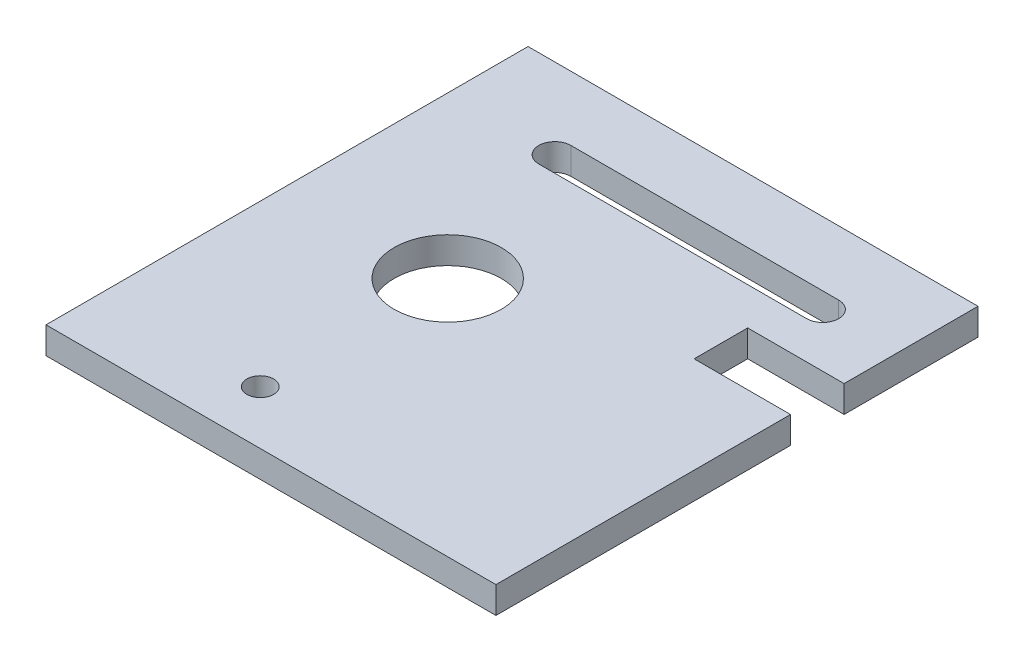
ISO-10303-21;
HEADER;
FILE_DESCRIPTION(('STEP AP214'),'2;1');
FILE_NAME('part.step','',(''),(''),'','','');
FILE_SCHEMA(('AUTOMOTIVE_DESIGN { 1 0 10303 214 1 1 1 1 }'));
ENDSEC;
DATA;
#1=APPLICATION_CONTEXT('core data for automotive mechanical design processes');
#2=APPLICATION_PROTOCOL_DEFINITION('international standard','automotive_design',2000,#1);
#3=PRODUCT_CONTEXT('',#1,'mechanical');
#4=PRODUCT('Part','Part','',(#3));
#5=PRODUCT_RELATED_PRODUCT_CATEGORY('part','',(#4));
#6=PRODUCT_DEFINITION_FORMATION('','',#4);
#7=PRODUCT_DEFINITION_CONTEXT('part definition',#1,'design');
#8=PRODUCT_DEFINITION('design','',#6,#7);
#9=PRODUCT_DEFINITION_SHAPE('','',#8);
#10=(LENGTH_UNIT() NAMED_UNIT(*) SI_UNIT(.MILLI.,.METRE.));
#11=(NAMED_UNIT(*) PLANE_ANGLE_UNIT() SI_UNIT($,.RADIAN.));
#12=(NAMED_UNIT(*) SI_UNIT($,.STERADIAN.) SOLID_ANGLE_UNIT());
#13=UNCERTAINTY_MEASURE_WITH_UNIT(LENGTH_MEASURE(1.E-05),#10,'distance_accuracy_value','');
#14=(GEOMETRIC_REPRESENTATION_CONTEXT(3) GLOBAL_UNCERTAINTY_ASSIGNED_CONTEXT((#13)) GLOBAL_UNIT_ASSIGNED_CONTEXT((#10,
#11,#12)) REPRESENTATION_CONTEXT('',''));
#15=CARTESIAN_POINT('',(0.,0.,0.));
#16=DIRECTION('',(0.,0.,1.));
#17=DIRECTION('',(1.,0.,0.));
#18=AXIS2_PLACEMENT_3D('',#15,#16,#17);
#19=CARTESIAN_POINT('',(84.,5.,0.));
#20=DIRECTION('',(-1.,0.,0.));
#21=DIRECTION('',(0.,0.,1.));
#22=AXIS2_PLACEMENT_3D('',#19,#20,#21);
#23=PLANE('',#22);
#24=DIRECTION('',(0.,0.,-1.));
#25=VECTOR('',#24,1.);
#26=CARTESIAN_POINT('',(84.,0.,0.));
#27=LINE('',#26,#25);
#28=CARTESIAN_POINT('',(84.,0.,0.));
#29=VERTEX_POINT('',#28);
#30=CARTESIAN_POINT('',(84.,0.,-55.));
#31=VERTEX_POINT('',#30);
#32=EDGE_CURVE('E217',#29,#31,#27,.T.);
#33=ORIENTED_EDGE('',*,*,#32,.T.);
#34=DIRECTION('',(0.,1.,0.));
#35=VECTOR('',#34,1.);
#36=CARTESIAN_POINT('',(84.,0.,-55.));
#37=LINE('',#36,#35);
#38=CARTESIAN_POINT('',(84.,5.,-55.));
#39=VERTEX_POINT('',#38);
#40=EDGE_CURVE('E178',#31,#39,#37,.T.);
#41=ORIENTED_EDGE('',*,*,#40,.T.);
#42=DIRECTION('',(0.,0.,-1.));
#43=VECTOR('',#42,1.);
#44=CARTESIAN_POINT('',(84.,5.,0.));
#45=LINE('',#44,#43);
#46=CARTESIAN_POINT('',(84.,5.,0.));
#47=VERTEX_POINT('',#46);
#48=EDGE_CURVE('E206',#47,#39,#45,.T.);
#49=ORIENTED_EDGE('',*,*,#48,.F.);
#50=DIRECTION('',(0.,-1.,0.));
#51=VECTOR('',#50,1.);
#52=CARTESIAN_POINT('',(84.,5.,0.));
#53=LINE('',#52,#51);
#54=EDGE_CURVE('E43',#47,#29,#53,.T.);
#55=ORIENTED_EDGE('',*,*,#54,.T.);
#56=EDGE_LOOP('',(#33,#41,#49,#55));
#57=FACE_BOUND('',#56,.T.);
#58=ADVANCED_FACE('F35',(#57),#23,.F.);
#59=CARTESIAN_POINT('',(0.,5.,-90.));
#60=DIRECTION('',(0.,-1.,0.));
#61=DIRECTION('',(0.,0.,-1.));
#62=AXIS2_PLACEMENT_3D('',#59,#60,#61);
#63=PLANE('',#62);
#64=DIRECTION('',(1.,0.,0.));
#65=VECTOR('',#64,1.);
#66=CARTESIAN_POINT('',(20.,5.,-72.));
#67=LINE('',#66,#65);
#68=CARTESIAN_POINT('',(20.,5.,-72.));
#69=VERTEX_POINT('',#68);
#70=CARTESIAN_POINT('',(70.,5.,-72.));
#71=VERTEX_POINT('',#70);
#72=EDGE_CURVE('E151',#69,#71,#67,.T.);
#73=ORIENTED_EDGE('',*,*,#72,.F.);
#74=CARTESIAN_POINT('',(20.,5.,-75.));
#75=DIRECTION('',(0.,1.,0.));
#76=DIRECTION('',(0.,0.,1.));
#77=AXIS2_PLACEMENT_3D('',#74,#75,#76);
#78=CIRCLE('',#77,3.);
#79=CARTESIAN_POINT('',(20.,5.,-78.));
#80=VERTEX_POINT('',#79);
#81=EDGE_CURVE('E50',#80,#69,#78,.T.);
#82=ORIENTED_EDGE('',*,*,#81,.F.);
#83=DIRECTION('',(-1.,0.,0.));
#84=VECTOR('',#83,1.);
#85=CARTESIAN_POINT('',(20.,5.,-78.));
#86=LINE('',#85,#84);
#87=CARTESIAN_POINT('',(70.,5.,-78.));
#88=VERTEX_POINT('',#87);
#89=EDGE_CURVE('E142',#88,#80,#86,.T.);
#90=ORIENTED_EDGE('',*,*,#89,.F.);
#91=CARTESIAN_POINT('',(70.,5.,-75.));
#92=DIRECTION('',(0.,1.,0.));
#93=DIRECTION('',(0.,0.,1.));
#94=AXIS2_PLACEMENT_3D('',#91,#92,#93);
#95=CIRCLE('',#94,3.);
#96=EDGE_CURVE('E145',#71,#88,#95,.T.);
#97=ORIENTED_EDGE('',*,*,#96,.F.);
#98=EDGE_LOOP('',(#73,#82,#90,#97));
#99=FACE_BOUND('',#98,.T.);
#100=CARTESIAN_POINT('',(30.,5.,-10.));
#101=DIRECTION('',(0.,1.,0.));
#102=DIRECTION('',(0.,0.,1.));
#103=AXIS2_PLACEMENT_3D('',#100,#101,#102);
#104=CIRCLE('',#103,2.49999999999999);
#105=CARTESIAN_POINT('',(30.,5.,-7.50000000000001));
#106=VERTEX_POINT('',#105);
#107=EDGE_CURVE('E181',#106,#106,#104,.T.);
#108=ORIENTED_EDGE('',*,*,#107,.F.);
#109=EDGE_LOOP('',(#108));
#110=FACE_BOUND('',#109,.T.);
#111=ORIENTED_EDGE('',*,*,#48,.T.);
#112=DIRECTION('',(1.,0.,0.));
#113=VECTOR('',#112,1.);
#114=CARTESIAN_POINT('',(84.,5.,-55.));
#115=LINE('',#114,#113);
#116=CARTESIAN_POINT('',(66.,5.,-55.));
#117=VERTEX_POINT('',#116);
#118=EDGE_CURVE('E165',#117,#39,#115,.T.);
#119=ORIENTED_EDGE('',*,*,#118,.F.);
#120=DIRECTION('',(0.,0.,1.));
#121=VECTOR('',#120,1.);
#122=CARTESIAN_POINT('',(66.,5.,-65.));
#123=LINE('',#122,#121);
#124=CARTESIAN_POINT('',(66.,5.,-65.));
#125=VERTEX_POINT('',#124);
#126=EDGE_CURVE('E174',#125,#117,#123,.T.);
#127=ORIENTED_EDGE('',*,*,#126,.F.);
#128=DIRECTION('',(-1.,0.,0.));
#129=VECTOR('',#128,1.);
#130=CARTESIAN_POINT('',(84.,5.,-65.));
#131=LINE('',#130,#129);
#132=CARTESIAN_POINT('',(84.,5.,-65.));
#133=VERTEX_POINT('',#132);
#134=EDGE_CURVE('E157',#133,#125,#131,.T.);
#135=ORIENTED_EDGE('',*,*,#134,.F.);
#136=CARTESIAN_POINT('',(84.,5.,-90.));
#137=VERTEX_POINT('',#136);
#138=EDGE_CURVE('E205',#133,#137,#45,.T.);
#139=ORIENTED_EDGE('',*,*,#138,.T.);
#140=DIRECTION('',(-1.,0.,0.));
#141=VECTOR('',#140,1.);
#142=CARTESIAN_POINT('',(0.,5.,-90.));
#143=LINE('',#142,#141);
#144=CARTESIAN_POINT('',(0.,5.,-90.));
#145=VERTEX_POINT('',#144);
#146=EDGE_CURVE('E209',#137,#145,#143,.T.);
#147=ORIENTED_EDGE('',*,*,#146,.T.);
#148=DIRECTION('',(0.,0.,1.));
#149=VECTOR('',#148,1.);
#150=CARTESIAN_POINT('',(0.,5.,0.));
#151=LINE('',#150,#149);
#152=CARTESIAN_POINT('',(0.,5.,0.));
#153=VERTEX_POINT('',#152);
#154=EDGE_CURVE('E199',#145,#153,#151,.T.);
#155=ORIENTED_EDGE('',*,*,#154,.T.);
#156=DIRECTION('',(1.,0.,0.));
#157=VECTOR('',#156,1.);
#158=CARTESIAN_POINT('',(0.,5.,0.));
#159=LINE('',#158,#157);
#160=EDGE_CURVE('E202',#153,#47,#159,.T.);
#161=ORIENTED_EDGE('',*,*,#160,.T.);
#162=EDGE_LOOP('',(#111,#119,#127,#135,#139,#147,#155,#161));
#163=FACE_BOUND('',#162,.T.);
#164=CARTESIAN_POINT('',(30.,5.,-45.));
#165=DIRECTION('',(0.,1.,0.));
#166=DIRECTION('',(0.,0.,1.));
#167=AXIS2_PLACEMENT_3D('',#164,#165,#166);
#168=CIRCLE('',#167,10.);
#169=CARTESIAN_POINT('',(30.,5.,-35.));
#170=VERTEX_POINT('',#169);
#171=EDGE_CURVE('E193',#170,#170,#168,.T.);
#172=ORIENTED_EDGE('',*,*,#171,.F.);
#173=EDGE_LOOP('',(#172));
#174=FACE_BOUND('',#173,.T.);
#175=ADVANCED_FACE('F239',(#99,#110,#163,#174),#63,.F.);
#176=CARTESIAN_POINT('',(0.,0.,-90.));
#177=DIRECTION('',(0.,-1.,0.));
#178=DIRECTION('',(0.,0.,-1.));
#179=AXIS2_PLACEMENT_3D('',#176,#177,#178);
#180=PLANE('',#179);
#181=CARTESIAN_POINT('',(20.,0.,-75.));
#182=DIRECTION('',(0.,1.,0.));
#183=DIRECTION('',(0.,0.,1.));
#184=AXIS2_PLACEMENT_3D('',#181,#182,#183);
#185=CIRCLE('',#184,3.);
#186=CARTESIAN_POINT('',(20.,0.,-78.));
#187=VERTEX_POINT('',#186);
#188=CARTESIAN_POINT('',(20.,0.,-72.));
#189=VERTEX_POINT('',#188);
#190=EDGE_CURVE('E126',#187,#189,#185,.T.);
#191=ORIENTED_EDGE('',*,*,#190,.T.);
#192=DIRECTION('',(1.,0.,0.));
#193=VECTOR('',#192,1.);
#194=CARTESIAN_POINT('',(20.,0.,-72.));
#195=LINE('',#194,#193);
#196=CARTESIAN_POINT('',(70.,0.,-72.));
#197=VERTEX_POINT('',#196);
#198=EDGE_CURVE('E135',#189,#197,#195,.T.);
#199=ORIENTED_EDGE('',*,*,#198,.T.);
#200=CARTESIAN_POINT('',(70.,0.,-75.));
#201=DIRECTION('',(0.,1.,0.));
#202=DIRECTION('',(0.,0.,1.));
#203=AXIS2_PLACEMENT_3D('',#200,#201,#202);
#204=CIRCLE('',#203,3.);
#205=CARTESIAN_POINT('',(70.,0.,-78.));
#206=VERTEX_POINT('',#205);
#207=EDGE_CURVE('E58',#197,#206,#204,.T.);
#208=ORIENTED_EDGE('',*,*,#207,.T.);
#209=DIRECTION('',(-1.,0.,0.));
#210=VECTOR('',#209,1.);
#211=CARTESIAN_POINT('',(20.,0.,-78.));
#212=LINE('',#211,#210);
#213=EDGE_CURVE('E132',#206,#187,#212,.T.);
#214=ORIENTED_EDGE('',*,*,#213,.T.);
#215=EDGE_LOOP('',(#191,#199,#208,#214));
#216=FACE_BOUND('',#215,.T.);
#217=DIRECTION('',(1.,0.,0.));
#218=VECTOR('',#217,1.);
#219=CARTESIAN_POINT('',(84.,0.,-55.));
#220=LINE('',#219,#218);
#221=CARTESIAN_POINT('',(66.,0.,-55.));
#222=VERTEX_POINT('',#221);
#223=EDGE_CURVE('E168',#222,#31,#220,.T.);
#224=ORIENTED_EDGE('',*,*,#223,.T.);
#225=ORIENTED_EDGE('',*,*,#32,.F.);
#226=DIRECTION('',(1.,0.,0.));
#227=VECTOR('',#226,1.);
#228=CARTESIAN_POINT('',(0.,0.,0.));
#229=LINE('',#228,#227);
#230=CARTESIAN_POINT('',(0.,0.,0.));
#231=VERTEX_POINT('',#230);
#232=EDGE_CURVE('E214',#231,#29,#229,.T.);
#233=ORIENTED_EDGE('',*,*,#232,.F.);
#234=DIRECTION('',(0.,0.,1.));
#235=VECTOR('',#234,1.);
#236=CARTESIAN_POINT('',(0.,0.,0.));
#237=LINE('',#236,#235);
#238=CARTESIAN_POINT('',(0.,0.,-90.));
#239=VERTEX_POINT('',#238);
#240=EDGE_CURVE('E196',#239,#231,#237,.T.);
#241=ORIENTED_EDGE('',*,*,#240,.F.);
#242=DIRECTION('',(-1.,0.,0.));
#243=VECTOR('',#242,1.);
#244=CARTESIAN_POINT('',(0.,0.,-90.));
#245=LINE('',#244,#243);
#246=CARTESIAN_POINT('',(84.,0.,-90.));
#247=VERTEX_POINT('',#246);
#248=EDGE_CURVE('E203',#247,#239,#245,.T.);
#249=ORIENTED_EDGE('',*,*,#248,.F.);
#250=CARTESIAN_POINT('',(84.,0.,-65.));
#251=VERTEX_POINT('',#250);
#252=EDGE_CURVE('E216',#251,#247,#27,.T.);
#253=ORIENTED_EDGE('',*,*,#252,.F.);
#254=DIRECTION('',(-1.,0.,0.));
#255=VECTOR('',#254,1.);
#256=CARTESIAN_POINT('',(84.,0.,-65.));
#257=LINE('',#256,#255);
#258=CARTESIAN_POINT('',(66.,0.,-65.));
#259=VERTEX_POINT('',#258);
#260=EDGE_CURVE('E161',#251,#259,#257,.T.);
#261=ORIENTED_EDGE('',*,*,#260,.T.);
#262=DIRECTION('',(0.,0.,1.));
#263=VECTOR('',#262,1.);
#264=CARTESIAN_POINT('',(66.,0.,-65.));
#265=LINE('',#264,#263);
#266=EDGE_CURVE('E164',#259,#222,#265,.T.);
#267=ORIENTED_EDGE('',*,*,#266,.T.);
#268=EDGE_LOOP('',(#224,#225,#233,#241,#249,#253,#261,#267));
#269=FACE_BOUND('',#268,.T.);
#270=CARTESIAN_POINT('',(30.,0.,-10.));
#271=DIRECTION('',(0.,1.,0.));
#272=DIRECTION('',(0.,0.,1.));
#273=AXIS2_PLACEMENT_3D('',#270,#271,#272);
#274=CIRCLE('',#273,2.5);
#275=CARTESIAN_POINT('',(30.,0.,-7.50000000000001));
#276=VERTEX_POINT('',#275);
#277=EDGE_CURVE('E189',#276,#276,#274,.T.);
#278=ORIENTED_EDGE('',*,*,#277,.T.);
#279=EDGE_LOOP('',(#278));
#280=FACE_BOUND('',#279,.T.);
#281=CARTESIAN_POINT('',(30.,0.,-45.));
#282=DIRECTION('',(0.,1.,0.));
#283=DIRECTION('',(0.,0.,1.));
#284=AXIS2_PLACEMENT_3D('',#281,#282,#283);
#285=CIRCLE('',#284,10.);
#286=CARTESIAN_POINT('',(30.,0.,-35.));
#287=VERTEX_POINT('',#286);
#288=EDGE_CURVE('E192',#287,#287,#285,.T.);
#289=ORIENTED_EDGE('',*,*,#288,.T.);
#290=EDGE_LOOP('',(#289));
#291=FACE_BOUND('',#290,.T.);
#292=ADVANCED_FACE('F139',(#216,#269,#280,#291),#180,.T.);
#293=CARTESIAN_POINT('',(0.,5.,0.));
#294=DIRECTION('',(1.,0.,0.));
#295=DIRECTION('',(0.,0.,-1.));
#296=AXIS2_PLACEMENT_3D('',#293,#294,#295);
#297=PLANE('',#296);
#298=ORIENTED_EDGE('',*,*,#240,.T.);
#299=DIRECTION('',(0.,-1.,0.));
#300=VECTOR('',#299,1.);
#301=CARTESIAN_POINT('',(0.,5.,0.));
#302=LINE('',#301,#300);
#303=EDGE_CURVE('E11',#153,#231,#302,.T.);
#304=ORIENTED_EDGE('',*,*,#303,.F.);
#305=ORIENTED_EDGE('',*,*,#154,.F.);
#306=DIRECTION('',(0.,-1.,0.));
#307=VECTOR('',#306,1.);
#308=CARTESIAN_POINT('',(0.,5.,-90.));
#309=LINE('',#308,#307);
#310=EDGE_CURVE('E211',#145,#239,#309,.T.);
#311=ORIENTED_EDGE('',*,*,#310,.T.);
#312=EDGE_LOOP('',(#298,#304,#305,#311));
#313=FACE_BOUND('',#312,.T.);
#314=ADVANCED_FACE('F37',(#313),#297,.F.);
#315=CARTESIAN_POINT('',(0.,5.,0.));
#316=DIRECTION('',(0.,0.,-1.));
#317=DIRECTION('',(-1.,0.,0.));
#318=AXIS2_PLACEMENT_3D('',#315,#316,#317);
#319=PLANE('',#318);
#320=ORIENTED_EDGE('',*,*,#232,.T.);
#321=ORIENTED_EDGE('',*,*,#54,.F.);
#322=ORIENTED_EDGE('',*,*,#160,.F.);
#323=ORIENTED_EDGE('',*,*,#303,.T.);
#324=EDGE_LOOP('',(#320,#321,#322,#323));
#325=FACE_BOUND('',#324,.T.);
#326=ADVANCED_FACE('F244',(#325),#319,.F.);
#327=ORIENTED_EDGE('',*,*,#138,.F.);
#328=DIRECTION('',(0.,1.,0.));
#329=VECTOR('',#328,1.);
#330=CARTESIAN_POINT('',(84.,0.,-65.));
#331=LINE('',#330,#329);
#332=EDGE_CURVE('E171',#251,#133,#331,.T.);
#333=ORIENTED_EDGE('',*,*,#332,.F.);
#334=ORIENTED_EDGE('',*,*,#252,.T.);
#335=DIRECTION('',(0.,-1.,0.));
#336=VECTOR('',#335,1.);
#337=CARTESIAN_POINT('',(84.,5.,-90.));
#338=LINE('',#337,#336);
#339=EDGE_CURVE('E223',#137,#247,#338,.T.);
#340=ORIENTED_EDGE('',*,*,#339,.F.);
#341=EDGE_LOOP('',(#327,#333,#334,#340));
#342=FACE_BOUND('',#341,.T.);
#343=ADVANCED_FACE('F255',(#342),#23,.F.);
#344=CARTESIAN_POINT('',(0.,5.,-90.));
#345=DIRECTION('',(0.,0.,1.));
#346=DIRECTION('',(1.,0.,0.));
#347=AXIS2_PLACEMENT_3D('',#344,#345,#346);
#348=PLANE('',#347);
#349=ORIENTED_EDGE('',*,*,#248,.T.);
#350=ORIENTED_EDGE('',*,*,#310,.F.);
#351=ORIENTED_EDGE('',*,*,#146,.F.);
#352=ORIENTED_EDGE('',*,*,#339,.T.);
#353=EDGE_LOOP('',(#349,#350,#351,#352));
#354=FACE_BOUND('',#353,.T.);
#355=ADVANCED_FACE('F250',(#354),#348,.F.);
#356=CARTESIAN_POINT('',(30.,5.,-45.));
#357=DIRECTION('',(0.,-1.,0.));
#358=DIRECTION('',(0.,0.,-1.));
#359=AXIS2_PLACEMENT_3D('',#356,#357,#358);
#360=CYLINDRICAL_SURFACE('',#359,10.);
#361=ORIENTED_EDGE('',*,*,#171,.T.);
#362=EDGE_LOOP('',(#361));
#363=FACE_BOUND('',#362,.T.);
#364=ORIENTED_EDGE('',*,*,#288,.F.);
#365=EDGE_LOOP('',(#364));
#366=FACE_BOUND('',#365,.T.);
#367=ADVANCED_FACE('F286',(#363,#366),#360,.F.);
#368=CARTESIAN_POINT('',(30.,5.,-10.));
#369=DIRECTION('',(0.,1.,0.));
#370=DIRECTION('',(0.,0.,1.));
#371=AXIS2_PLACEMENT_3D('',#368,#369,#370);
#372=CYLINDRICAL_SURFACE('',#371,2.49999999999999);
#373=ORIENTED_EDGE('',*,*,#277,.F.);
#374=EDGE_LOOP('',(#373));
#375=FACE_BOUND('',#374,.T.);
#376=ORIENTED_EDGE('',*,*,#107,.T.);
#377=EDGE_LOOP('',(#376));
#378=FACE_BOUND('',#377,.T.);
#379=ADVANCED_FACE('F269',(#375,#378),#372,.F.);
#380=CARTESIAN_POINT('',(84.,0.,-55.));
#381=DIRECTION('',(0.,0.,1.));
#382=DIRECTION('',(1.,0.,0.));
#383=AXIS2_PLACEMENT_3D('',#380,#381,#382);
#384=PLANE('',#383);
#385=ORIENTED_EDGE('',*,*,#118,.T.);
#386=ORIENTED_EDGE('',*,*,#40,.F.);
#387=ORIENTED_EDGE('',*,*,#223,.F.);
#388=DIRECTION('',(0.,1.,0.));
#389=VECTOR('',#388,1.);
#390=CARTESIAN_POINT('',(66.,0.,-55.));
#391=LINE('',#390,#389);
#392=EDGE_CURVE('E182',#222,#117,#391,.T.);
#393=ORIENTED_EDGE('',*,*,#392,.T.);
#394=EDGE_LOOP('',(#385,#386,#387,#393));
#395=FACE_BOUND('',#394,.T.);
#396=ADVANCED_FACE('F236',(#395),#384,.F.);
#397=CARTESIAN_POINT('',(66.,0.,-65.));
#398=DIRECTION('',(-1.,0.,0.));
#399=DIRECTION('',(0.,0.,1.));
#400=AXIS2_PLACEMENT_3D('',#397,#398,#399);
#401=PLANE('',#400);
#402=ORIENTED_EDGE('',*,*,#126,.T.);
#403=ORIENTED_EDGE('',*,*,#392,.F.);
#404=ORIENTED_EDGE('',*,*,#266,.F.);
#405=DIRECTION('',(0.,1.,0.));
#406=VECTOR('',#405,1.);
#407=CARTESIAN_POINT('',(66.,0.,-65.));
#408=LINE('',#407,#406);
#409=EDGE_CURVE('E184',#259,#125,#408,.T.);
#410=ORIENTED_EDGE('',*,*,#409,.T.);
#411=EDGE_LOOP('',(#402,#403,#404,#410));
#412=FACE_BOUND('',#411,.T.);
#413=ADVANCED_FACE('F261',(#412),#401,.F.);
#414=CARTESIAN_POINT('',(84.,0.,-65.));
#415=DIRECTION('',(0.,0.,-1.));
#416=DIRECTION('',(-1.,0.,0.));
#417=AXIS2_PLACEMENT_3D('',#414,#415,#416);
#418=PLANE('',#417);
#419=ORIENTED_EDGE('',*,*,#134,.T.);
#420=ORIENTED_EDGE('',*,*,#409,.F.);
#421=ORIENTED_EDGE('',*,*,#260,.F.);
#422=ORIENTED_EDGE('',*,*,#332,.T.);
#423=EDGE_LOOP('',(#419,#420,#421,#422));
#424=FACE_BOUND('',#423,.T.);
#425=ADVANCED_FACE('F259',(#424),#418,.F.);
#426=CARTESIAN_POINT('',(20.,0.,-75.));
#427=DIRECTION('',(0.,1.,0.));
#428=DIRECTION('',(0.,0.,1.));
#429=AXIS2_PLACEMENT_3D('',#426,#427,#428);
#430=CYLINDRICAL_SURFACE('',#429,3.);
#431=ORIENTED_EDGE('',*,*,#81,.T.);
#432=DIRECTION('',(0.,1.,0.));
#433=VECTOR('',#432,1.);
#434=CARTESIAN_POINT('',(20.,0.,-72.));
#435=LINE('',#434,#433);
#436=EDGE_CURVE('E122',#189,#69,#435,.T.);
#437=ORIENTED_EDGE('',*,*,#436,.F.);
#438=ORIENTED_EDGE('',*,*,#190,.F.);
#439=DIRECTION('',(0.,1.,0.));
#440=VECTOR('',#439,1.);
#441=CARTESIAN_POINT('',(20.,0.,-78.));
#442=LINE('',#441,#440);
#443=EDGE_CURVE('E155',#187,#80,#442,.T.);
#444=ORIENTED_EDGE('',*,*,#443,.T.);
#445=EDGE_LOOP('',(#431,#437,#438,#444));
#446=FACE_BOUND('',#445,.T.);
#447=ADVANCED_FACE('F124',(#446),#430,.F.);
#448=CARTESIAN_POINT('',(20.,0.,-78.));
#449=DIRECTION('',(0.,0.,-1.));
#450=DIRECTION('',(-1.,0.,0.));
#451=AXIS2_PLACEMENT_3D('',#448,#449,#450);
#452=PLANE('',#451);
#453=ORIENTED_EDGE('',*,*,#89,.T.);
#454=ORIENTED_EDGE('',*,*,#443,.F.);
#455=ORIENTED_EDGE('',*,*,#213,.F.);
#456=DIRECTION('',(0.,1.,0.));
#457=VECTOR('',#456,1.);
#458=CARTESIAN_POINT('',(70.,0.,-78.));
#459=LINE('',#458,#457);
#460=EDGE_CURVE('E158',#206,#88,#459,.T.);
#461=ORIENTED_EDGE('',*,*,#460,.T.);
#462=EDGE_LOOP('',(#453,#454,#455,#461));
#463=FACE_BOUND('',#462,.T.);
#464=ADVANCED_FACE('F334',(#463),#452,.F.);
#465=CARTESIAN_POINT('',(70.,0.,-75.));
#466=DIRECTION('',(0.,1.,0.));
#467=DIRECTION('',(0.,0.,1.));
#468=AXIS2_PLACEMENT_3D('',#465,#466,#467);
#469=CYLINDRICAL_SURFACE('',#468,3.);
#470=ORIENTED_EDGE('',*,*,#96,.T.);
#471=ORIENTED_EDGE('',*,*,#460,.F.);
#472=ORIENTED_EDGE('',*,*,#207,.F.);
#473=DIRECTION('',(0.,1.,0.));
#474=VECTOR('',#473,1.);
#475=CARTESIAN_POINT('',(70.,0.,-72.));
#476=LINE('',#475,#474);
#477=EDGE_CURVE('E131',#197,#71,#476,.T.);
#478=ORIENTED_EDGE('',*,*,#477,.T.);
#479=EDGE_LOOP('',(#470,#471,#472,#478));
#480=FACE_BOUND('',#479,.T.);
#481=ADVANCED_FACE('F343',(#480),#469,.F.);
#482=CARTESIAN_POINT('',(20.,0.,-72.));
#483=DIRECTION('',(0.,0.,1.));
#484=DIRECTION('',(1.,0.,0.));
#485=AXIS2_PLACEMENT_3D('',#482,#483,#484);
#486=PLANE('',#485);
#487=ORIENTED_EDGE('',*,*,#72,.T.);
#488=ORIENTED_EDGE('',*,*,#477,.F.);
#489=ORIENTED_EDGE('',*,*,#198,.F.);
#490=ORIENTED_EDGE('',*,*,#436,.T.);
#491=EDGE_LOOP('',(#487,#488,#489,#490));
#492=FACE_BOUND('',#491,.T.);
#493=ADVANCED_FACE('F136',(#492),#486,.F.);
#494=CLOSED_SHELL('',(#58,#175,#292,#314,#326,#343,#355,#367,#379,#396,#413,#425,#447,#464,#481,#493));
#495=MANIFOLD_SOLID_BREP('B2',#494);
#496=ADVANCED_BREP_SHAPE_REPRESENTATION('',(#18,#495),#14);
#497=SHAPE_DEFINITION_REPRESENTATION(#9,#496);
ENDSEC;
END-ISO-10303-21;
